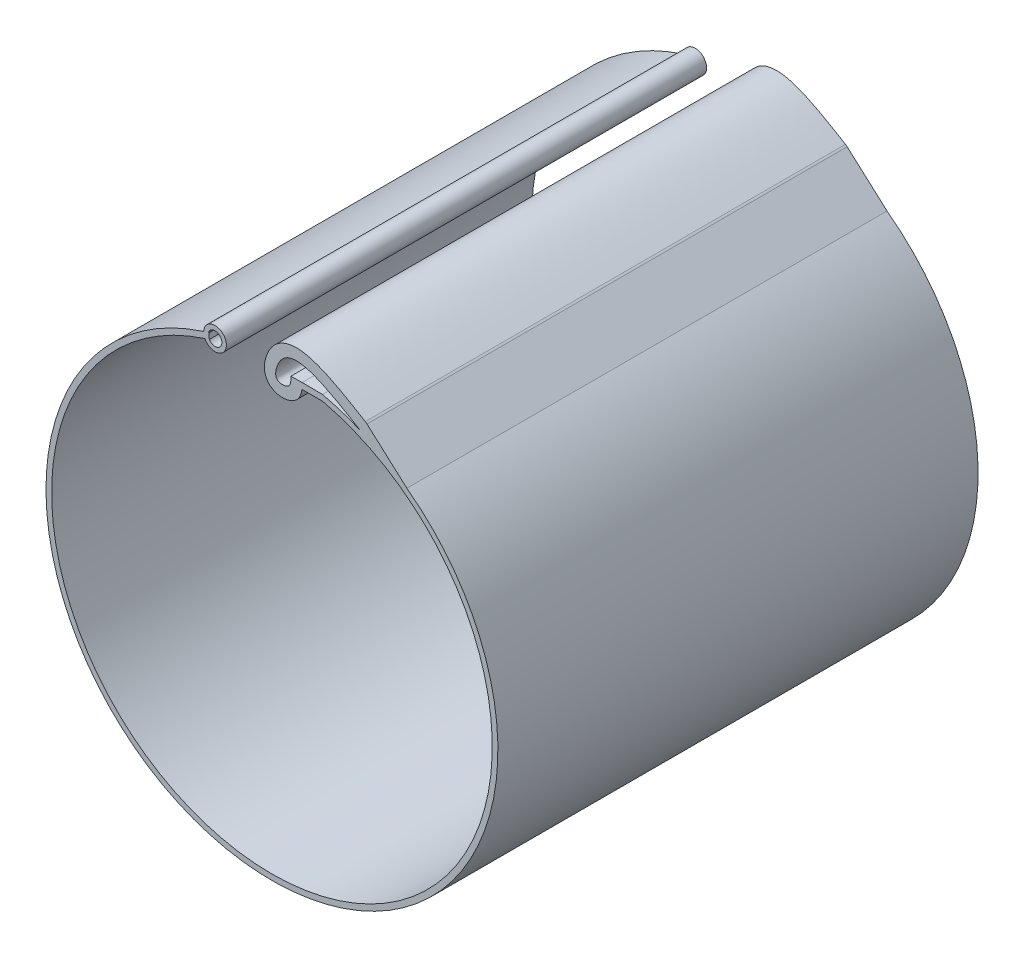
from build123d import *

# Parameters (mm, degrees)
SKETCH1_R      = 50.8
EXTRUDE1_DEPTH = 107.95
SKETCH2_R      = 49.53
EXTRUDE2_DEPTH = 107.95
EXTRUDE3_DEPTH = 127
SKETCH4_R      = 2.554781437
SKETCH4_R_2    = 1.538781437
EXTRUDE4_DEPTH = 107.95
EXTRUDE5_START = -107.95
EXTRUDE5_DEPTH = 107.95
EXTRUDE6_DEPTH = 107.95
FILLET1_R      = 2.54


with BuildPart() as part:
    # Sketch1 → Extrude1 (new body)
    with BuildSketch(Plane.XY):
        Circle(SKETCH1_R)
    extrude(amount=EXTRUDE1_DEPTH)

    # Sketch2 → Extrude2 (cut)
    with BuildSketch(Plane.XY.offset(107.95)):
        Circle(SKETCH2_R)
    extrude(amount=-EXTRUDE2_DEPTH, mode=Mode.SUBTRACT)

    # Sketch3 → Extrude3 (cut)
    with BuildSketch(Plane.XY.offset(107.95)):
        Polygon((-14.087937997, 47.48421741), (11.396910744, 48.200947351), (11.308296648, 51.351808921), (-14.176552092, 50.63507898), align=None)
    extrude(amount=-EXTRUDE3_DEPTH, mode=Mode.SUBTRACT)

    # Sketch4 → Extrude4 (add)
    with BuildSketch(Plane.XY.offset(107.95)):
        with Locations((-12.795233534, 48.318941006)):
            Circle(SKETCH4_R)
        with Locations((-12.795233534, 48.318941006)):
            Circle(SKETCH4_R_2, mode=Mode.SUBTRACT)
    extrude(amount=-EXTRUDE4_DEPTH)

    # Sketch5 → Extrude5 (add)
    with BuildSketch(Plane.XY.offset(107.95).offset(EXTRUDE5_START)):
        with BuildLine():
            Line((6.783435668, 49.556039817), (4.243791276, 49.513538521))
            add(Edge.make_bspline(
                [(4.243791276, 49.513538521), (4.257802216, 48.67632156), (4.287990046, 46.872462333), (0.417675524, 46.747344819), (2.390910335, 57.245210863), (11.682825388, 51.6682052), (19.878438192, 46.74919994)],
                knots=[0, 0, 0, 0, 0.083748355, 0.180443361, 0.277138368, 1, 1, 1, 1], degree=3))
            ThreePointArc((19.878438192, 46.74919994), (25.285308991, 44.060108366), (30.334888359, 40.748430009))
            Line((30.334888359, 40.748430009), (21.185577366, 48.927039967))
            add(Edge.make_bspline(
                [(6.783435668, 49.556039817), (6.786360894, 49.381244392), (6.792191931, 49.058491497), (6.775889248, 48.413013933), (6.681895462, 47.654921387), (6.408871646, 46.740092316), (5.896038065, 45.90847189), (5.274347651, 45.327630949), (4.631022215, 44.901326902), (3.845477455, 44.584061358), (2.92820073, 44.407505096), (2.008884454, 44.391291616), (1.057605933, 44.547860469), (0.209510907, 44.886201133), (-0.494715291, 45.397739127), (-1.125670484, 46.087251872), (-1.566949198, 47.032008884), (-1.721234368, 48.029437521), (-1.692658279, 48.872322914), (-1.528533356, 49.857806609), (-1.21259029, 50.870228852), (-0.747897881, 51.946977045), (-0.144994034, 52.938539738), (0.840566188, 54.102216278), (2.41065918, 55.180824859), (4.511041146, 55.720329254), (6.574935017, 55.687420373), (8.6017245, 55.277189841), (10.632835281, 54.592693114), (13.379183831, 53.39805505), (16.903298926, 51.497420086), (19.768207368, 49.777745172), (21.185577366, 48.927039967)],
                knots=[0, 0, 0, 0, 0.015625, 0.03125, 0.046875, 0.0625, 0.078125, 0.0859375, 0.09375, 0.109375, 0.125, 0.140625, 0.15625, 0.171875, 0.1796875, 0.1875, 0.203125, 0.21875, 0.234375, 0.25, 0.28125, 0.3125, 0.34375, 0.375, 0.4375, 0.5, 0.5625, 0.625, 0.6875, 0.75, 0.875, 1, 1, 1, 1], degree=3))
        make_face()
    extrude(amount=EXTRUDE5_DEPTH)

    # Sketch6 → Extrude6 (add)
    with BuildSketch(Plane.XY.offset(107.95)):
        with BuildLine():
            Line((11.396910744, 48.200947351), (11.359995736, 49.513538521))
            Line((11.359995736, 49.513538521), (6.783435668, 49.556039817))
            add(Edge.make_bspline(
                [(6.783435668, 49.556039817), (6.786360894, 49.381244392), (6.792191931, 49.058491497), (6.779859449, 48.570207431), (6.752095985, 48.266837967), (6.744933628, 48.200947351)],
                knots=[0, 0, 0, 0, 0.015625, 0.03125, 0.035459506, 0.035459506, 0.035459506, 0.035459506], degree=3))
            Line((6.744933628, 48.200947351), (11.396910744, 48.200947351))
        make_face()
    extrude(amount=-EXTRUDE6_DEPTH)

    # Fillet1
    fillet1_edges = [part.edges().sort_by_distance(p)[0] for p in [
        (21.185577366, 48.927039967, 53.975),
    ]]
    fillet(fillet1_edges, radius=FILLET1_R)


solid = part.part
